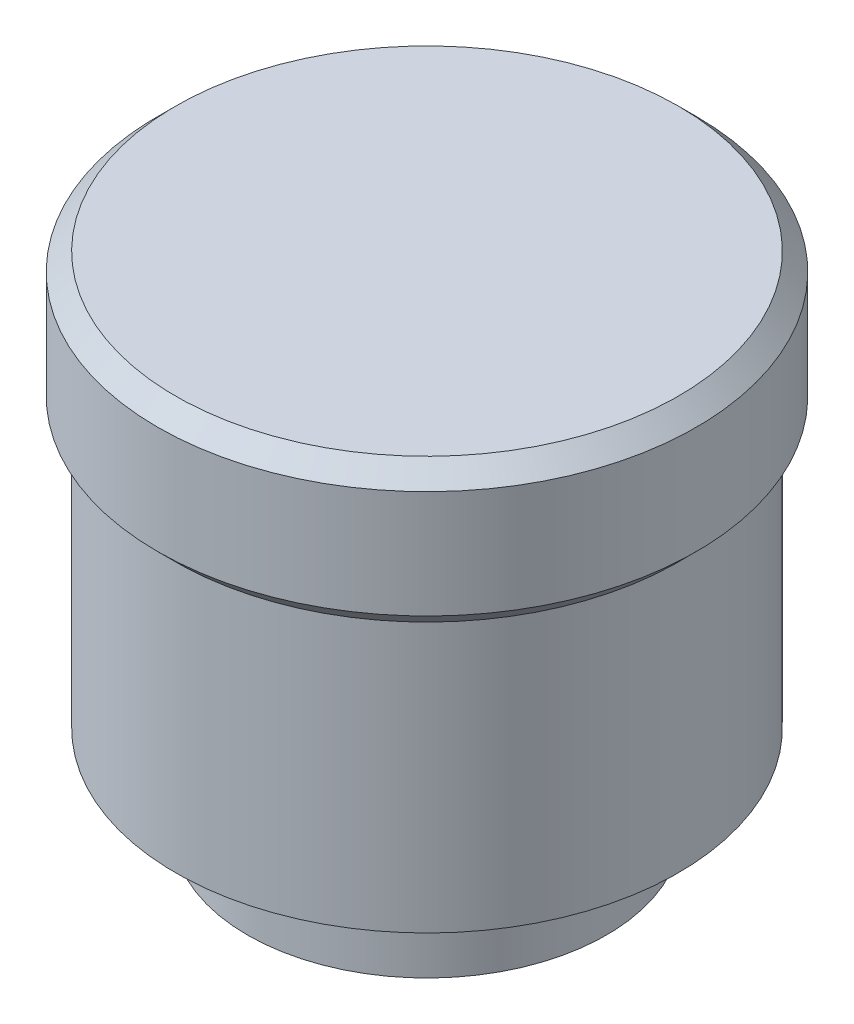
from build123d import *

# Parameters (mm, degrees)
M4_TAPPED_HOLE1_D     = 3.3
M4_TAPPED_HOLE1_DEPTH = 16
M4_TAPPED_HOLE1_TIP   = 0.991420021


with BuildPart() as part:
    # Sketch1 → Revolve1 (revolve)
    with BuildSketch(Plane(origin=(0, 0, 0), x_dir=(0, 0, -1), z_dir=(1, 0, 0))):
        Polygon((0, 0), (0, 28), (14, 28), (15, 27), (15, 21), (14, 20), (14, 5), (10, 5), (10, 0), align=None)
    revolve(axis=Axis((0, 0, 0), (0, 1, 0)))

    # M4 Tapped Hole1
    with Locations(Plane(origin=(0, 0, -4), x_dir=(0, 0, -1), z_dir=(0, -1, 0))):
        with Locations((0, 0)):
            Hole(M4_TAPPED_HOLE1_D / 2, depth=M4_TAPPED_HOLE1_DEPTH)
            with Locations((0, 0, -(M4_TAPPED_HOLE1_DEPTH + M4_TAPPED_HOLE1_TIP / 2))):  # 118° drill point
                Cone(0, M4_TAPPED_HOLE1_D / 2, M4_TAPPED_HOLE1_TIP, mode=Mode.SUBTRACT)


solid = part.part
